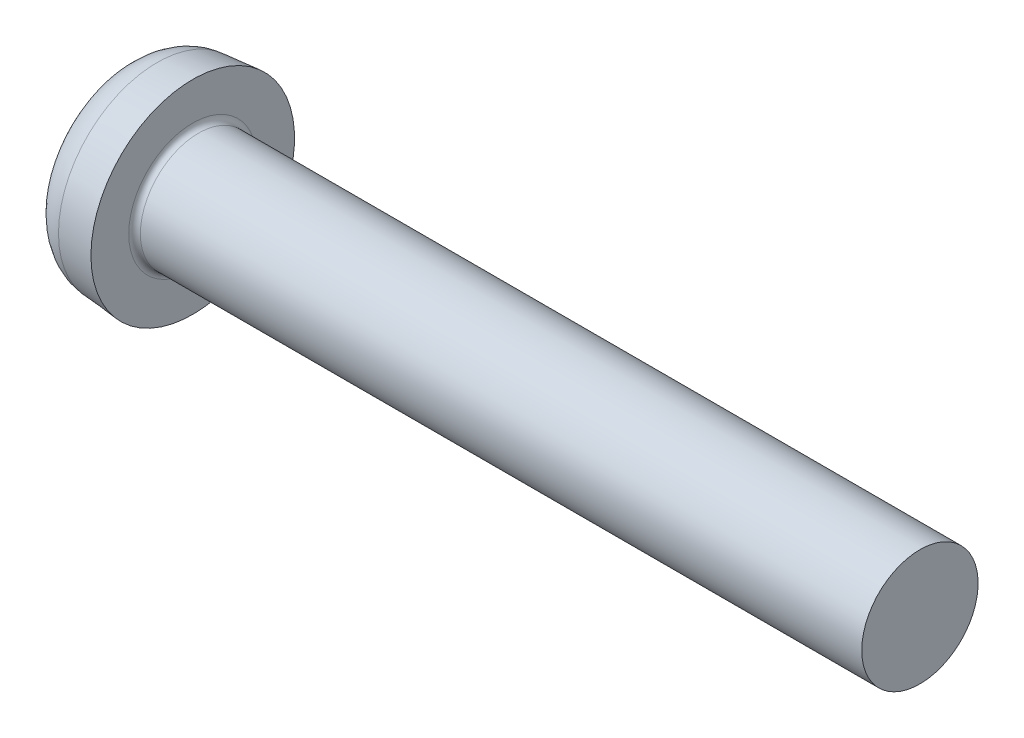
from build123d import *

# Parameters (mm, degrees)
FILLET1_R    = 0.4
RECPAT_COUNT = 2
RECPAT_ANGLE = 90


with BuildPart() as part:
    # BodySke → BaseBody (revolve)
    with BuildSketch(Plane.XY, mode=Mode.PRIVATE) as basebody_sk:
        with BuildLine():
            Line((5.4, 4), (5.4, 7))
            Line((5.4, 7), (2.956076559, 6.786184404))
            ThreePointArc((2.956076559, 6.786184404), (1.52557938, 6.199578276), (0.681056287, 4.904506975))
            ThreePointArc((0.681056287, 4.904506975), (0.171077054, 2.475784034), (0, 0))
            Line((0, 0), (55.4, 0))
            Line((55.4, 0), (55.4, 4))
            Line((55.4, 4), (5.4, 4))
        make_face()
    revolve(basebody_sk.sketch.rotate(Axis((0, 0, 0), (1, 0, 0)), 90), axis=Axis((0, 0, 0), (1, 0, 0)))

    # Fillet1
    fillet1_edges = [part.edges().sort_by_distance(p)[0] for p in [
        (5.4, 0, -4),
    ]]
    fillet(fillet1_edges, radius=FILLET1_R)

    # RecSkeTop → Recess section 0
    with BuildSketch(Plane(origin=(0, 0, 0), x_dir=(0, 0, -1), z_dir=(1, 0, 0))):
        with BuildLine():
            Line((-0.858, 3.9), (0.858, 3.9))
            Line((0.858, 3.9), (0.858, -3.9))
            Line((0.858, -3.9), (-0.858, -3.9))
            Line((-0.858, -3.9), (-0.858, 3.9))
        make_face()
    # RecSkeBot → Recess section 1
    with BuildSketch(Plane(origin=(4.36, 0, 0), x_dir=(0, 0, -1), z_dir=(1, 0, 0))):
        with BuildLine():
            Line((-0.858, 1.726184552), (0.858, 1.726184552))
            Line((0.858, 1.726184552), (0.858, -1.726184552))
            Line((0.858, -1.726184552), (-0.858, -1.726184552))
            Line((-0.858, -1.726184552), (-0.858, 1.726184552))
        make_face()
    recess = loft(mode=Mode.SUBTRACT)

    # RecPat: Recess ×2 about axis
    recpat_axis = Axis((0, 0, 0), (1, 0, 0))
    for i in range(1, RECPAT_COUNT):
        add(recess.rotate(recpat_axis, i * RECPAT_ANGLE / (RECPAT_COUNT - 1)), mode=Mode.SUBTRACT)

    # RecCorSke → RecessCore (revolve, cut)
    with BuildSketch(Plane.XY, mode=Mode.PRIVATE) as recesscore_sk:
        Polygon((0, 0), (0, 1.8876), (4.36, 1.5827191), (4.874256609, 0), align=None)
    revolve(recesscore_sk.sketch.rotate(Axis((0, 0, 0), (1, 0, 0)), 346.937939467), axis=Axis((0, 0, 0), (1, 0, 0)), mode=Mode.SUBTRACT)


solid = part.part
